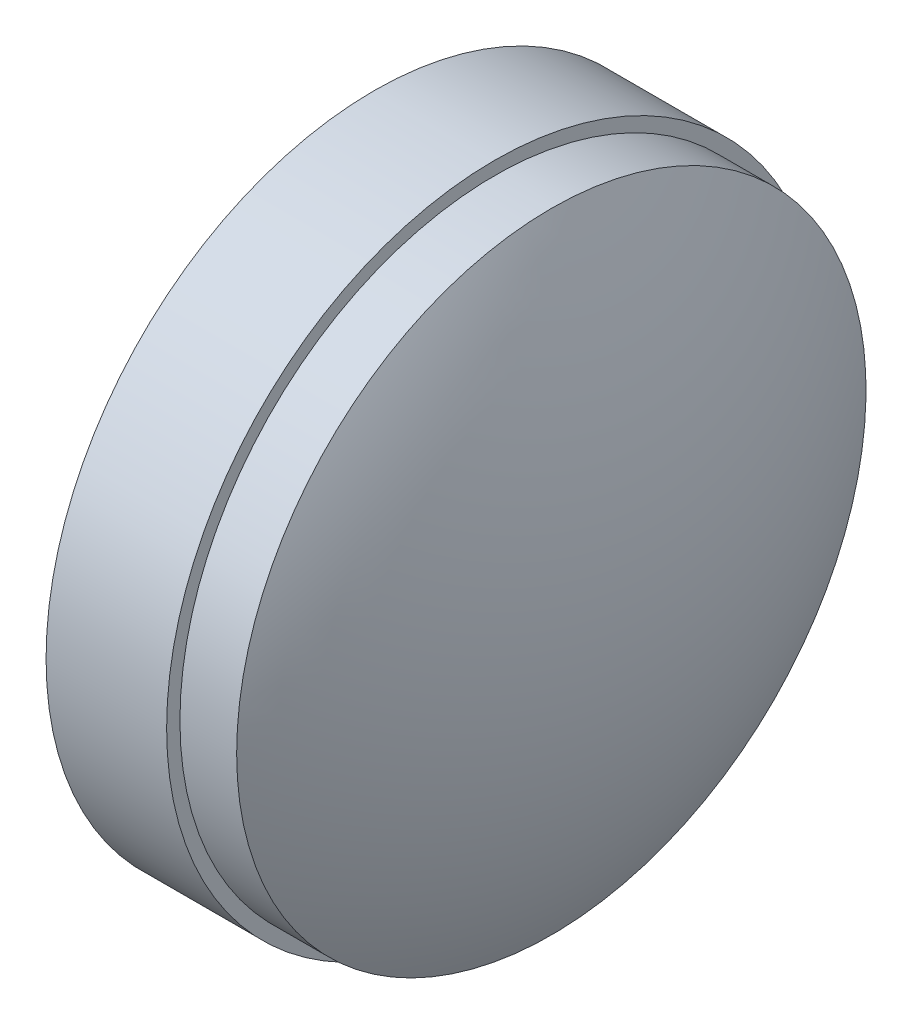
ISO-10303-21;
HEADER;
FILE_DESCRIPTION(('STEP AP214'),'2;1');
FILE_NAME('part.step','',(''),(''),'','','');
FILE_SCHEMA(('AUTOMOTIVE_DESIGN { 1 0 10303 214 1 1 1 1 }'));
ENDSEC;
DATA;
#1=APPLICATION_CONTEXT('core data for automotive mechanical design processes');
#2=APPLICATION_PROTOCOL_DEFINITION('international standard','automotive_design',2000,#1);
#3=PRODUCT_CONTEXT('',#1,'mechanical');
#4=PRODUCT('Part','Part','',(#3));
#5=PRODUCT_RELATED_PRODUCT_CATEGORY('part','',(#4));
#6=PRODUCT_DEFINITION_FORMATION('','',#4);
#7=PRODUCT_DEFINITION_CONTEXT('part definition',#1,'design');
#8=PRODUCT_DEFINITION('design','',#6,#7);
#9=PRODUCT_DEFINITION_SHAPE('','',#8);
#10=(LENGTH_UNIT() NAMED_UNIT(*) SI_UNIT(.MILLI.,.METRE.));
#11=(NAMED_UNIT(*) PLANE_ANGLE_UNIT() SI_UNIT($,.RADIAN.));
#12=(NAMED_UNIT(*) SI_UNIT($,.STERADIAN.) SOLID_ANGLE_UNIT());
#13=UNCERTAINTY_MEASURE_WITH_UNIT(LENGTH_MEASURE(1.E-05),#10,'distance_accuracy_value','');
#14=(GEOMETRIC_REPRESENTATION_CONTEXT(3) GLOBAL_UNCERTAINTY_ASSIGNED_CONTEXT((#13)) GLOBAL_UNIT_ASSIGNED_CONTEXT((#10,
#11,#12)) REPRESENTATION_CONTEXT('',''));
#15=CARTESIAN_POINT('',(0.,0.,0.));
#16=DIRECTION('',(0.,0.,1.));
#17=DIRECTION('',(1.,0.,0.));
#18=AXIS2_PLACEMENT_3D('',#15,#16,#17);
#19=CARTESIAN_POINT('',(-42.2812500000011,0.,0.));
#20=DIRECTION('',(-1.,0.,0.));
#21=DIRECTION('',(0.,1.,0.));
#22=AXIS2_PLACEMENT_3D('',#19,#20,#21);
#23=SPHERICAL_SURFACE('',#22,43.2812500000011);
#24=CARTESIAN_POINT('',(0.,0.,0.));
#25=DIRECTION('',(-1.,0.,0.));
#26=DIRECTION('',(0.,0.,1.));
#27=AXIS2_PLACEMENT_3D('',#24,#25,#26);
#28=CIRCLE('',#27,9.25);
#29=CARTESIAN_POINT('',(0.,0.,9.25));
#30=VERTEX_POINT('',#29);
#31=EDGE_CURVE('E58',#30,#30,#28,.T.);
#32=ORIENTED_EDGE('',*,*,#31,.T.);
#33=EDGE_LOOP('',(#32));
#34=FACE_BOUND('',#33,.T.);
#35=ADVANCED_FACE('F41',(#34),#23,.F.);
#36=CARTESIAN_POINT('',(-11.2142566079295,0.,0.));
#37=DIRECTION('',(-1.,0.,0.));
#38=DIRECTION('',(0.,1.,0.));
#39=AXIS2_PLACEMENT_3D('',#36,#37,#38);
#40=SPHERICAL_SURFACE('',#39,18.4842566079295);
#41=CARTESIAN_POINT('',(5.,0.,0.));
#42=DIRECTION('',(-1.,0.,0.));
#43=DIRECTION('',(0.,0.,1.));
#44=AXIS2_PLACEMENT_3D('',#41,#42,#43);
#45=CIRCLE('',#44,8.875);
#46=CARTESIAN_POINT('',(5.,0.,8.875));
#47=VERTEX_POINT('',#46);
#48=EDGE_CURVE('E10',#47,#47,#45,.T.);
#49=ORIENTED_EDGE('',*,*,#48,.F.);
#50=EDGE_LOOP('',(#49));
#51=FACE_BOUND('',#50,.T.);
#52=ADVANCED_FACE('F77',(#51),#40,.T.);
#53=CARTESIAN_POINT('',(-5.42754093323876,0.,0.));
#54=DIRECTION('',(-1.,0.,0.));
#55=DIRECTION('',(0.,0.,1.));
#56=AXIS2_PLACEMENT_3D('',#53,#54,#55);
#57=CYLINDRICAL_SURFACE('',#56,8.875);
#58=ORIENTED_EDGE('',*,*,#48,.T.);
#59=EDGE_LOOP('',(#58));
#60=FACE_BOUND('',#59,.T.);
#61=CARTESIAN_POINT('',(3.4,0.,0.));
#62=DIRECTION('',(-1.,0.,0.));
#63=DIRECTION('',(0.,0.,1.));
#64=AXIS2_PLACEMENT_3D('',#61,#62,#63);
#65=CIRCLE('',#64,8.875);
#66=CARTESIAN_POINT('',(3.4,0.,8.875));
#67=VERTEX_POINT('',#66);
#68=EDGE_CURVE('E48',#67,#67,#65,.T.);
#69=ORIENTED_EDGE('',*,*,#68,.F.);
#70=EDGE_LOOP('',(#69));
#71=FACE_BOUND('',#70,.T.);
#72=ADVANCED_FACE('F74',(#60,#71),#57,.T.);
#73=CARTESIAN_POINT('',(3.4,0.,0.));
#74=DIRECTION('',(1.,0.,0.));
#75=DIRECTION('',(0.,0.,-1.));
#76=AXIS2_PLACEMENT_3D('',#73,#74,#75);
#77=PLANE('',#76);
#78=ORIENTED_EDGE('',*,*,#68,.T.);
#79=EDGE_LOOP('',(#78));
#80=FACE_BOUND('',#79,.T.);
#81=CARTESIAN_POINT('',(3.4,0.,0.));
#82=DIRECTION('',(-1.,0.,0.));
#83=DIRECTION('',(0.,0.,1.));
#84=AXIS2_PLACEMENT_3D('',#81,#82,#83);
#85=CIRCLE('',#84,9.25);
#86=CARTESIAN_POINT('',(3.4,0.,9.25));
#87=VERTEX_POINT('',#86);
#88=EDGE_CURVE('E53',#87,#87,#85,.T.);
#89=ORIENTED_EDGE('',*,*,#88,.F.);
#90=EDGE_LOOP('',(#89));
#91=FACE_BOUND('',#90,.T.);
#92=ADVANCED_FACE('F68',(#80,#91),#77,.T.);
#93=CARTESIAN_POINT('',(-5.42754093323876,0.,0.));
#94=DIRECTION('',(-1.,0.,0.));
#95=DIRECTION('',(0.,0.,1.));
#96=AXIS2_PLACEMENT_3D('',#93,#94,#95);
#97=CYLINDRICAL_SURFACE('',#96,9.25);
#98=ORIENTED_EDGE('',*,*,#88,.T.);
#99=EDGE_LOOP('',(#98));
#100=FACE_BOUND('',#99,.T.);
#101=ORIENTED_EDGE('',*,*,#31,.F.);
#102=EDGE_LOOP('',(#101));
#103=FACE_BOUND('',#102,.T.);
#104=ADVANCED_FACE('F66',(#100,#103),#97,.T.);
#105=CLOSED_SHELL('',(#35,#52,#72,#92,#104));
#106=MANIFOLD_SOLID_BREP('B2',#105);
#107=ADVANCED_BREP_SHAPE_REPRESENTATION('',(#18,#106),#14);
#108=SHAPE_DEFINITION_REPRESENTATION(#9,#107);
ENDSEC;
END-ISO-10303-21;
